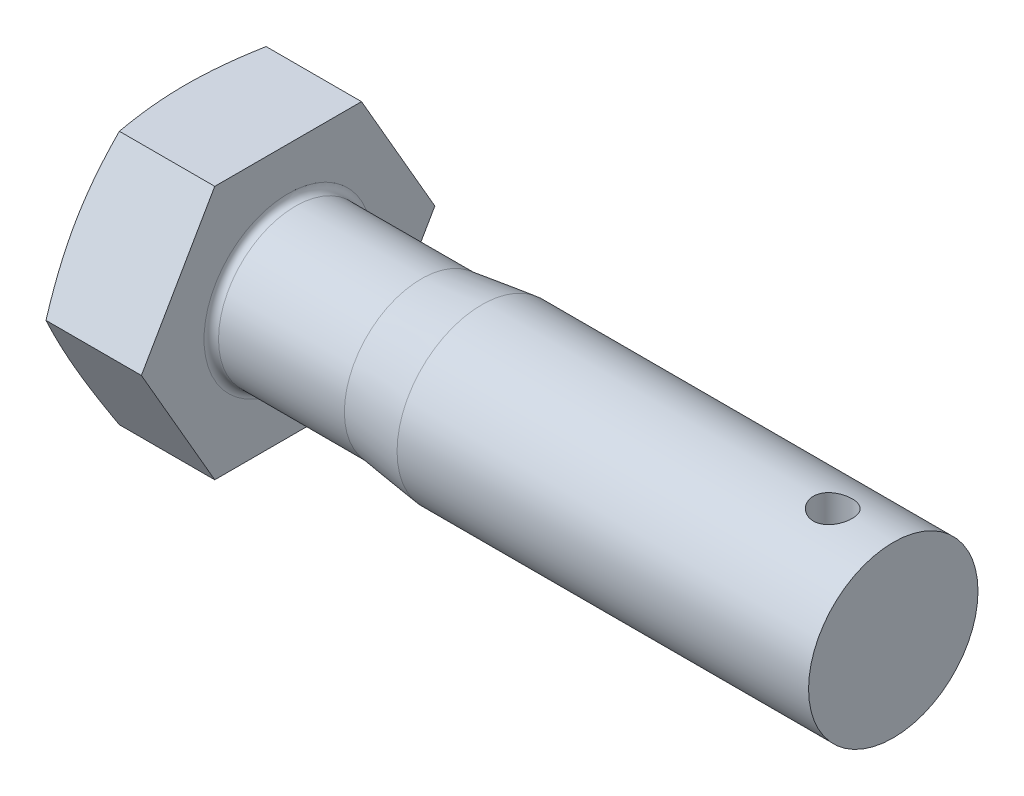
ISO-10303-21;
HEADER;
FILE_DESCRIPTION(('STEP AP214'),'2;1');
FILE_NAME('part.step','',(''),(''),'','','');
FILE_SCHEMA(('AUTOMOTIVE_DESIGN { 1 0 10303 214 1 1 1 1 }'));
ENDSEC;
DATA;
#1=APPLICATION_CONTEXT('core data for automotive mechanical design processes');
#2=APPLICATION_PROTOCOL_DEFINITION('international standard','automotive_design',2000,#1);
#3=PRODUCT_CONTEXT('',#1,'mechanical');
#4=PRODUCT('Part','Part','',(#3));
#5=PRODUCT_RELATED_PRODUCT_CATEGORY('part','',(#4));
#6=PRODUCT_DEFINITION_FORMATION('','',#4);
#7=PRODUCT_DEFINITION_CONTEXT('part definition',#1,'design');
#8=PRODUCT_DEFINITION('design','',#6,#7);
#9=PRODUCT_DEFINITION_SHAPE('','',#8);
#10=(LENGTH_UNIT() NAMED_UNIT(*) SI_UNIT(.MILLI.,.METRE.));
#11=(NAMED_UNIT(*) PLANE_ANGLE_UNIT() SI_UNIT($,.RADIAN.));
#12=(NAMED_UNIT(*) SI_UNIT($,.STERADIAN.) SOLID_ANGLE_UNIT());
#13=UNCERTAINTY_MEASURE_WITH_UNIT(LENGTH_MEASURE(1.E-05),#10,'distance_accuracy_value','');
#14=(GEOMETRIC_REPRESENTATION_CONTEXT(3) GLOBAL_UNCERTAINTY_ASSIGNED_CONTEXT((#13)) GLOBAL_UNIT_ASSIGNED_CONTEXT((#10,
#11,#12)) REPRESENTATION_CONTEXT('',''));
#15=CARTESIAN_POINT('',(0.,0.,0.));
#16=DIRECTION('',(0.,0.,1.));
#17=DIRECTION('',(1.,0.,0.));
#18=AXIS2_PLACEMENT_3D('',#15,#16,#17);
#19=CARTESIAN_POINT('',(0.,-10.5,-6.06217782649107));
#20=DIRECTION('',(1.,0.,0.));
#21=DIRECTION('',(0.,0.,-1.));
#22=AXIS2_PLACEMENT_3D('',#19,#20,#21);
#23=PLANE('',#22);
#24=CARTESIAN_POINT('',(0.,0.,0.));
#25=DIRECTION('',(-1.,0.,0.));
#26=DIRECTION('',(0.,0.,1.));
#27=AXIS2_PLACEMENT_3D('',#24,#25,#26);
#28=CIRCLE('',#27,9.6);
#29=CARTESIAN_POINT('',(0.,0.,9.6));
#30=VERTEX_POINT('',#29);
#31=EDGE_CURVE('E98',#30,#30,#28,.T.);
#32=ORIENTED_EDGE('',*,*,#31,.T.);
#33=EDGE_LOOP('',(#32));
#34=FACE_BOUND('',#33,.T.);
#35=CARTESIAN_POINT('',(0.,0.,0.));
#36=DIRECTION('',(1.,0.,0.));
#37=DIRECTION('',(0.,0.,-1.));
#38=AXIS2_PLACEMENT_3D('',#35,#36,#37);
#39=CIRCLE('',#38,7.85);
#40=CARTESIAN_POINT('',(0.,0.,-7.85));
#41=VERTEX_POINT('',#40);
#42=EDGE_CURVE('E231',#41,#41,#39,.T.);
#43=ORIENTED_EDGE('',*,*,#42,.T.);
#44=EDGE_LOOP('',(#43));
#45=FACE_BOUND('',#44,.T.);
#46=ADVANCED_FACE('F32',(#34,#45),#23,.F.);
#47=CARTESIAN_POINT('',(8.8,-10.5,6.06217782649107));
#48=DIRECTION('',(0.,1.,0.));
#49=DIRECTION('',(0.,0.,1.));
#50=AXIS2_PLACEMENT_3D('',#47,#48,#49);
#51=PLANE('',#50);
#52=CARTESIAN_POINT('',(3.4773071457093,-10.5,-16.019329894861));
#53=CARTESIAN_POINT('',(3.33283348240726,-10.5,-15.5445898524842));
#54=CARTESIAN_POINT('',(3.19005256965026,-10.5,-15.0693250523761));
#55=CARTESIAN_POINT('',(2.90881278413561,-10.5,-14.1174788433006));
#56=CARTESIAN_POINT('',(2.77035425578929,-10.5,-13.6408973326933));
#57=CARTESIAN_POINT('',(2.49846354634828,-10.5,-12.6853280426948));
#58=CARTESIAN_POINT('',(2.36504131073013,-10.5,-12.2063374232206));
#59=CARTESIAN_POINT('',(2.10479333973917,-10.5,-11.2465699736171));
#60=CARTESIAN_POINT('',(1.97796748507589,-10.5,-10.7657931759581));
#61=CARTESIAN_POINT('',(1.73407377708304,-10.5,-9.80813433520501));
#62=CARTESIAN_POINT('',(1.61690406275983,-10.5,-9.33127836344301));
#63=CARTESIAN_POINT('',(1.39258733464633,-10.5,-8.37519002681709));
#64=CARTESIAN_POINT('',(1.28544048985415,-10.5,-7.89595762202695));
#65=CARTESIAN_POINT('',(1.08367761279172,-10.5,-6.93501487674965));
#66=CARTESIAN_POINT('',(0.989057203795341,-10.5,-6.45330546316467));
#67=CARTESIAN_POINT('',(0.815236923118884,-10.5,-5.48709167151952));
#68=CARTESIAN_POINT('',(0.736036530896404,-10.5,-5.00258738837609));
#69=CARTESIAN_POINT('',(0.604125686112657,-10.5,-4.08539679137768));
#70=CARTESIAN_POINT('',(0.549439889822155,-10.5,-3.65299724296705));
#71=CARTESIAN_POINT('',(0.456973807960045,-10.5,-2.78637928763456));
#72=CARTESIAN_POINT('',(0.419193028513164,-10.5,-2.3521609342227));
#73=CARTESIAN_POINT('',(0.362356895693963,-10.5,-1.48278672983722));
#74=CARTESIAN_POINT('',(0.343288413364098,-10.5,-1.04763175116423));
#75=CARTESIAN_POINT('',(0.324841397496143,-10.5,-0.176900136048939));
#76=CARTESIAN_POINT('',(0.325462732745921,-10.5,0.258676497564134));
#77=CARTESIAN_POINT('',(0.346415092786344,-10.5,1.13158357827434));
#78=CARTESIAN_POINT('',(0.366847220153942,-10.5,1.56891155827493));
#79=CARTESIAN_POINT('',(0.426482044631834,-10.5,2.44227473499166));
#80=CARTESIAN_POINT('',(0.46568519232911,-10.5,2.87830990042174));
#81=CARTESIAN_POINT('',(0.561034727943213,-10.5,3.74887561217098));
#82=CARTESIAN_POINT('',(0.617195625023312,-10.5,4.18340454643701));
#83=CARTESIAN_POINT('',(0.744191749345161,-10.5,5.05028830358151));
#84=CARTESIAN_POINT('',(0.815027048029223,-10.5,5.48264311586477));
#85=CARTESIAN_POINT('',(0.973611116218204,-10.5,6.37050891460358));
#86=CARTESIAN_POINT('',(1.06211008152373,-10.5,6.82588472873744));
#87=CARTESIAN_POINT('',(1.25049804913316,-10.5,7.7342893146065));
#88=CARTESIAN_POINT('',(1.35038791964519,-10.5,8.18731790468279));
#89=CARTESIAN_POINT('',(1.5594505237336,-10.5,9.09135527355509));
#90=CARTESIAN_POINT('',(1.66862598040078,-10.5,9.54236341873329));
#91=CARTESIAN_POINT('',(1.89447776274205,-10.5,10.4424768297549));
#92=CARTESIAN_POINT('',(2.01115390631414,-10.5,10.8915821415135));
#93=CARTESIAN_POINT('',(2.25075411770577,-10.5,11.7887385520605));
#94=CARTESIAN_POINT('',(2.3736860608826,-10.5,12.2367875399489));
#95=CARTESIAN_POINT('',(2.624533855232,-10.5,13.1314862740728));
#96=CARTESIAN_POINT('',(2.75244972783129,-10.5,13.5781360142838));
#97=CARTESIAN_POINT('',(3.012348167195,-10.5,14.4701640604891));
#98=CARTESIAN_POINT('',(3.14433002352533,-10.5,14.9155425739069));
#99=CARTESIAN_POINT('',(3.41167894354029,-10.5,15.8052835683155));
#100=CARTESIAN_POINT('',(3.5470460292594,-10.5,16.2496460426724));
#101=CARTESIAN_POINT('',(3.95424477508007,-10.5,17.5713644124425));
#102=CARTESIAN_POINT('',(4.23015128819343,-10.5,18.4474646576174));
#103=CARTESIAN_POINT('',(4.78973757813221,-10.5,20.1972132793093));
#104=CARTESIAN_POINT('',(5.07341773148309,-10.5,21.0708615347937));
#105=CARTESIAN_POINT('',(5.64538538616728,-10.5,22.812966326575));
#106=CARTESIAN_POINT('',(5.93365126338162,-10.5,23.6814299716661));
#107=CARTESIAN_POINT('',(6.36922672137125,-10.5,24.9830205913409));
#108=CARTESIAN_POINT('',(6.51494203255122,-10.5,25.4166824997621));
#109=CARTESIAN_POINT('',(6.80730926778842,-10.5,26.2836893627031));
#110=CARTESIAN_POINT('',(6.95396118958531,-10.5,26.717034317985));
#111=CARTESIAN_POINT('',(7.10101876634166,-10.5,27.1502416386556));
#112=B_SPLINE_CURVE_WITH_KNOTS('',3,(#52,#53,#54,#55,#56,#57,#58,#59,#60,#61,#62,#63,#64,#65,
#66,#67,#68,#69,#70,#71,#72,#73,#74,#75,#76,#77,#78,#79,#80,#81,#82,#83,#84,#85,#86,#87,#88,#89,
#90,#91,#92,#93,#94,#95,#96,#97,#98,#99,#100,#101,#102,#103,#104,#105,#106,#107,#108,#109,#110,
#111),.UNSPECIFIED.,.F.,.F.,(4,2,2,2,2,2,2,2,2,2,2,2,2,2,2,2,2,2,2,2,2,2,2,2,2,2,2,2,2,4),(0.,
1.4887203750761,2.97755907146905,4.46919854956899,5.96081104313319,7.43384568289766,
8.90690515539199,10.3794485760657,11.8519422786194,13.1591861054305,14.4663917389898,
15.7726795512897,17.0789586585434,18.3919395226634,19.7049519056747,21.0190909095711,
22.3332363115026,23.7247442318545,25.1163582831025,26.5083818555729,27.9003716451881,
29.2941593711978,30.6879530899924,32.0815046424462,33.4750652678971,36.230561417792,
38.9861912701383,41.7313416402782,43.1038059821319,44.4762670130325),.UNSPECIFIED.);
#113=CARTESIAN_POINT('',(0.918790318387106,-10.5,-6.06217782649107));
#114=VERTEX_POINT('',#113);
#115=CARTESIAN_POINT('',(0.918790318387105,-10.5,6.06217782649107));
#116=VERTEX_POINT('',#115);
#117=EDGE_CURVE('E54',#114,#116,#112,.T.);
#118=ORIENTED_EDGE('',*,*,#117,.F.);
#119=DIRECTION('',(-1.,0.,0.));
#120=VECTOR('',#119,1.);
#121=CARTESIAN_POINT('',(8.8,-10.5,-6.06217782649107));
#122=LINE('',#121,#120);
#123=CARTESIAN_POINT('',(8.8,-10.5,-6.06217782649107));
#124=VERTEX_POINT('',#123);
#125=EDGE_CURVE('E123',#124,#114,#122,.T.);
#126=ORIENTED_EDGE('',*,*,#125,.F.);
#127=DIRECTION('',(0.,0.,-1.));
#128=VECTOR('',#127,1.);
#129=CARTESIAN_POINT('',(8.8,-10.5,6.06217782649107));
#130=LINE('',#129,#128);
#131=CARTESIAN_POINT('',(8.8,-10.5,6.06217782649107));
#132=VERTEX_POINT('',#131);
#133=EDGE_CURVE('E260',#132,#124,#130,.T.);
#134=ORIENTED_EDGE('',*,*,#133,.F.);
#135=DIRECTION('',(-1.,0.,0.));
#136=VECTOR('',#135,1.);
#137=CARTESIAN_POINT('',(8.8,-10.5,6.06217782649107));
#138=LINE('',#137,#136);
#139=EDGE_CURVE('E111',#132,#116,#138,.T.);
#140=ORIENTED_EDGE('',*,*,#139,.T.);
#141=EDGE_LOOP('',(#118,#126,#134,#140));
#142=FACE_BOUND('',#141,.T.);
#143=ADVANCED_FACE('F34',(#142),#51,.F.);
#144=CARTESIAN_POINT('',(8.8,-10.5,-6.06217782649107));
#145=DIRECTION('',(0.,0.5,0.866025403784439));
#146=DIRECTION('',(0.,-0.866025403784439,0.5));
#147=AXIS2_PLACEMENT_3D('',#144,#145,#146);
#148=PLANE('',#147);
#149=CARTESIAN_POINT('',(0.918832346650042,0.000200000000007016,-12.124471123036));
#150=CARTESIAN_POINT('',(0.827422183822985,-0.434644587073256,-11.8734134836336));
#151=CARTESIAN_POINT('',(0.744268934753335,-0.870923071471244,-11.6215279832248));
#152=CARTESIAN_POINT('',(0.597973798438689,-1.74631667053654,-11.1161192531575));
#153=CARTESIAN_POINT('',(0.53484756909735,-2.18543373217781,-10.8625948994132));
#154=CARTESIAN_POINT('',(0.432742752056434,-3.06163146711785,-10.3567219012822));
#155=CARTESIAN_POINT('',(0.393541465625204,-3.49869213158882,-10.1043848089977));
#156=CARTESIAN_POINT('',(0.340961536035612,-4.37383549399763,-9.59912055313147));
#157=CARTESIAN_POINT('',(0.327573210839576,-4.81191774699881,-9.34619364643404));
#158=CARTESIAN_POINT('',(0.327573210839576,-5.68808225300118,-8.84033983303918));
#159=CARTESIAN_POINT('',(0.340961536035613,-6.12616450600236,-8.58741292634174));
#160=CARTESIAN_POINT('',(0.393541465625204,-7.00130786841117,-8.08214867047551));
#161=CARTESIAN_POINT('',(0.432742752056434,-7.43836853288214,-7.829811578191));
#162=CARTESIAN_POINT('',(0.534847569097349,-8.31456626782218,-7.32393858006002));
#163=CARTESIAN_POINT('',(0.597973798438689,-8.75368332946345,-7.07041422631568));
#164=CARTESIAN_POINT('',(0.744268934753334,-9.62907692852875,-6.56500549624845));
#165=CARTESIAN_POINT('',(0.827422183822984,-10.0653554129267,-6.31311999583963));
#166=CARTESIAN_POINT('',(0.91883234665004,-10.5002,-6.06206235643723));
#167=B_SPLINE_CURVE_WITH_KNOTS('',3,(#149,#150,#151,#152,#153,#154,#155,#156,#157,#158,#159,
#160,#161,#162,#163,#164,#165,#166),.UNSPECIFIED.,.F.,.F.,(4,2,2,2,2,2,2,2,4),(0.,
1.5312621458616,3.06371855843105,4.58168385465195,6.09907967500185,7.61647549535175,
9.13444079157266,10.6668972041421,12.1981593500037),.UNSPECIFIED.);
#168=CARTESIAN_POINT('',(0.918790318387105,0.,-12.1243556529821));
#169=VERTEX_POINT('',#168);
#170=EDGE_CURVE('E193',#169,#114,#167,.T.);
#171=ORIENTED_EDGE('',*,*,#170,.F.);
#172=DIRECTION('',(-1.,0.,0.));
#173=VECTOR('',#172,1.);
#174=CARTESIAN_POINT('',(8.8,0.,-12.1243556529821));
#175=LINE('',#174,#173);
#176=CARTESIAN_POINT('',(8.8,0.,-12.1243556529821));
#177=VERTEX_POINT('',#176);
#178=EDGE_CURVE('E120',#177,#169,#175,.T.);
#179=ORIENTED_EDGE('',*,*,#178,.F.);
#180=DIRECTION('',(0.,0.866025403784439,-0.5));
#181=VECTOR('',#180,1.);
#182=CARTESIAN_POINT('',(8.8,-10.5,-6.06217782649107));
#183=LINE('',#182,#181);
#184=EDGE_CURVE('E261',#124,#177,#183,.T.);
#185=ORIENTED_EDGE('',*,*,#184,.F.);
#186=ORIENTED_EDGE('',*,*,#125,.T.);
#187=EDGE_LOOP('',(#171,#179,#185,#186));
#188=FACE_BOUND('',#187,.T.);
#189=ADVANCED_FACE('F201',(#188),#148,.F.);
#190=CARTESIAN_POINT('',(8.8,0.,-12.1243556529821));
#191=DIRECTION('',(0.,-0.5,0.866025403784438));
#192=DIRECTION('',(0.,-0.866025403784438,-0.5));
#193=AXIS2_PLACEMENT_3D('',#190,#191,#192);
#194=PLANE('',#193);
#195=CARTESIAN_POINT('',(0.918832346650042,10.5002,-6.06206235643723));
#196=CARTESIAN_POINT('',(0.827422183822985,10.0653554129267,-6.31311999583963));
#197=CARTESIAN_POINT('',(0.744268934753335,9.62907692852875,-6.56500549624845));
#198=CARTESIAN_POINT('',(0.59797379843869,8.75368332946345,-7.07041422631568));
#199=CARTESIAN_POINT('',(0.534847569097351,8.31456626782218,-7.32393858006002));
#200=CARTESIAN_POINT('',(0.432742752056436,7.43836853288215,-7.829811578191));
#201=CARTESIAN_POINT('',(0.393541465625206,7.00130786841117,-8.08214867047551));
#202=CARTESIAN_POINT('',(0.340961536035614,6.12616450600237,-8.58741292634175));
#203=CARTESIAN_POINT('',(0.327573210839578,5.68808225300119,-8.84033983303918));
#204=CARTESIAN_POINT('',(0.327573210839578,4.81191774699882,-9.34619364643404));
#205=CARTESIAN_POINT('',(0.340961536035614,4.37383549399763,-9.59912055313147));
#206=CARTESIAN_POINT('',(0.393541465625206,3.49869213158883,-10.1043848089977));
#207=CARTESIAN_POINT('',(0.432742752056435,3.06163146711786,-10.3567219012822));
#208=CARTESIAN_POINT('',(0.534847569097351,2.18543373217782,-10.8625948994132));
#209=CARTESIAN_POINT('',(0.59797379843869,1.74631667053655,-11.1161192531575));
#210=CARTESIAN_POINT('',(0.744268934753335,0.870923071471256,-11.6215279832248));
#211=CARTESIAN_POINT('',(0.827422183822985,0.434644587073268,-11.8734134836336));
#212=CARTESIAN_POINT('',(0.918832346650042,-0.000199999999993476,-12.124471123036));
#213=B_SPLINE_CURVE_WITH_KNOTS('',3,(#195,#196,#197,#198,#199,#200,#201,#202,#203,#204,#205,
#206,#207,#208,#209,#210,#211,#212),.UNSPECIFIED.,.F.,.F.,(4,2,2,2,2,2,2,2,4),(0.,
1.5312621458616,3.06371855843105,4.58168385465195,6.09907967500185,7.61647549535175,
9.13444079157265,10.6668972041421,12.1981593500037),.UNSPECIFIED.);
#214=CARTESIAN_POINT('',(0.918790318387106,10.5,-6.06217782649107));
#215=VERTEX_POINT('',#214);
#216=EDGE_CURVE('E187',#215,#169,#213,.T.);
#217=ORIENTED_EDGE('',*,*,#216,.F.);
#218=DIRECTION('',(-1.,0.,0.));
#219=VECTOR('',#218,1.);
#220=CARTESIAN_POINT('',(8.8,10.5,-6.06217782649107));
#221=LINE('',#220,#219);
#222=CARTESIAN_POINT('',(8.8,10.5,-6.06217782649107));
#223=VERTEX_POINT('',#222);
#224=EDGE_CURVE('E113',#223,#215,#221,.T.);
#225=ORIENTED_EDGE('',*,*,#224,.F.);
#226=DIRECTION('',(0.,0.866025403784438,0.5));
#227=VECTOR('',#226,1.);
#228=CARTESIAN_POINT('',(8.8,0.,-12.1243556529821));
#229=LINE('',#228,#227);
#230=EDGE_CURVE('E265',#177,#223,#229,.T.);
#231=ORIENTED_EDGE('',*,*,#230,.F.);
#232=ORIENTED_EDGE('',*,*,#178,.T.);
#233=EDGE_LOOP('',(#217,#225,#231,#232));
#234=FACE_BOUND('',#233,.T.);
#235=ADVANCED_FACE('F204',(#234),#194,.F.);
#236=CARTESIAN_POINT('',(8.8,10.5,-6.06217782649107));
#237=DIRECTION('',(0.,-1.,0.));
#238=DIRECTION('',(0.,0.,-1.));
#239=AXIS2_PLACEMENT_3D('',#236,#237,#238);
#240=PLANE('',#239);
#241=CARTESIAN_POINT('',(3.47730714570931,10.5,-16.019329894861));
#242=CARTESIAN_POINT('',(3.33283348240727,10.5,-15.5445898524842));
#243=CARTESIAN_POINT('',(3.19005256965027,10.5,-15.0693250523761));
#244=CARTESIAN_POINT('',(2.90881278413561,10.5,-14.1174788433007));
#245=CARTESIAN_POINT('',(2.77035425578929,10.5,-13.6408973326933));
#246=CARTESIAN_POINT('',(2.49846354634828,10.5,-12.6853280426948));
#247=CARTESIAN_POINT('',(2.36504131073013,10.5,-12.2063374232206));
#248=CARTESIAN_POINT('',(2.10479333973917,10.5,-11.2465699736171));
#249=CARTESIAN_POINT('',(1.97796748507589,10.5,-10.7657931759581));
#250=CARTESIAN_POINT('',(1.73407377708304,10.5,-9.80813433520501));
#251=CARTESIAN_POINT('',(1.61690406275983,10.5,-9.33127836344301));
#252=CARTESIAN_POINT('',(1.39258733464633,10.5,-8.37519002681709));
#253=CARTESIAN_POINT('',(1.28544048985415,10.5,-7.89595762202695));
#254=CARTESIAN_POINT('',(1.08367761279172,10.5,-6.93501487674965));
#255=CARTESIAN_POINT('',(0.989057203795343,10.5,-6.45330546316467));
#256=CARTESIAN_POINT('',(0.815236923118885,10.5,-5.48709167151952));
#257=CARTESIAN_POINT('',(0.736036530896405,10.5,-5.00258738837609));
#258=CARTESIAN_POINT('',(0.604125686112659,10.5,-4.08539679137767));
#259=CARTESIAN_POINT('',(0.549439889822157,10.5,-3.65299724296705));
#260=CARTESIAN_POINT('',(0.456973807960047,10.5,-2.78637928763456));
#261=CARTESIAN_POINT('',(0.419193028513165,10.5,-2.3521609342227));
#262=CARTESIAN_POINT('',(0.362356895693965,10.5,-1.48278672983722));
#263=CARTESIAN_POINT('',(0.3432884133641,10.5,-1.04763175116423));
#264=CARTESIAN_POINT('',(0.324841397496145,10.5,-0.176900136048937));
#265=CARTESIAN_POINT('',(0.325462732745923,10.5,0.258676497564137));
#266=CARTESIAN_POINT('',(0.346415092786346,10.5,1.13158357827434));
#267=CARTESIAN_POINT('',(0.366847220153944,10.5,1.56891155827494));
#268=CARTESIAN_POINT('',(0.426482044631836,10.5,2.44227473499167));
#269=CARTESIAN_POINT('',(0.465685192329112,10.5,2.87830990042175));
#270=CARTESIAN_POINT('',(0.561034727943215,10.5,3.74887561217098));
#271=CARTESIAN_POINT('',(0.617195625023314,10.5,4.18340454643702));
#272=CARTESIAN_POINT('',(0.744191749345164,10.5,5.05028830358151));
#273=CARTESIAN_POINT('',(0.815027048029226,10.5,5.48264311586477));
#274=CARTESIAN_POINT('',(0.973611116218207,10.5,6.37050891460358));
#275=CARTESIAN_POINT('',(1.06211008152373,10.5,6.82588472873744));
#276=CARTESIAN_POINT('',(1.25049804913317,10.5,7.73428931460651));
#277=CARTESIAN_POINT('',(1.35038791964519,10.5,8.1873179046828));
#278=CARTESIAN_POINT('',(1.55945052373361,10.5,9.09135527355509));
#279=CARTESIAN_POINT('',(1.66862598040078,10.5,9.54236341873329));
#280=CARTESIAN_POINT('',(1.89447776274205,10.5,10.4424768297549));
#281=CARTESIAN_POINT('',(2.01115390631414,10.5,10.8915821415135));
#282=CARTESIAN_POINT('',(2.25075411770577,10.5,11.7887385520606));
#283=CARTESIAN_POINT('',(2.37368606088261,10.5,12.2367875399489));
#284=CARTESIAN_POINT('',(2.624533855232,10.5,13.1314862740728));
#285=CARTESIAN_POINT('',(2.75244972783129,10.5,13.5781360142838));
#286=CARTESIAN_POINT('',(3.012348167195,10.5,14.4701640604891));
#287=CARTESIAN_POINT('',(3.14433002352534,10.5,14.9155425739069));
#288=CARTESIAN_POINT('',(3.41167894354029,10.5,15.8052835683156));
#289=CARTESIAN_POINT('',(3.5470460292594,10.5,16.2496460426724));
#290=CARTESIAN_POINT('',(3.95424477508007,10.5,17.5713644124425));
#291=CARTESIAN_POINT('',(4.23015128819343,10.5,18.4474646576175));
#292=CARTESIAN_POINT('',(4.78973757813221,10.5,20.1972132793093));
#293=CARTESIAN_POINT('',(5.07341773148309,10.5,21.0708615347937));
#294=CARTESIAN_POINT('',(5.64538538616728,10.5,22.812966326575));
#295=CARTESIAN_POINT('',(5.93365126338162,10.5,23.6814299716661));
#296=CARTESIAN_POINT('',(6.36922672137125,10.5,24.9830205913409));
#297=CARTESIAN_POINT('',(6.51494203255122,10.5,25.4166824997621));
#298=CARTESIAN_POINT('',(6.80730926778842,10.5,26.2836893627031));
#299=CARTESIAN_POINT('',(6.95396118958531,10.5,26.717034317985));
#300=CARTESIAN_POINT('',(7.10101876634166,10.5,27.1502416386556));
#301=B_SPLINE_CURVE_WITH_KNOTS('',3,(#241,#242,#243,#244,#245,#246,#247,#248,#249,#250,#251,
#252,#253,#254,#255,#256,#257,#258,#259,#260,#261,#262,#263,#264,#265,#266,#267,#268,#269,#270,
#271,#272,#273,#274,#275,#276,#277,#278,#279,#280,#281,#282,#283,#284,#285,#286,#287,#288,#289,
#290,#291,#292,#293,#294,#295,#296,#297,#298,#299,#300),.UNSPECIFIED.,.F.,.F.,(4,2,2,2,2,2,2,2,
2,2,2,2,2,2,2,2,2,2,2,2,2,2,2,2,2,2,2,2,2,4),(0.,1.4887203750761,2.97755907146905,
4.469198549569,5.96081104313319,7.43384568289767,8.906905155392,10.3794485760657,
11.8519422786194,13.1591861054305,14.4663917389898,15.7726795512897,17.0789586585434,
18.3919395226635,19.7049519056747,21.0190909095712,22.3332363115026,23.7247442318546,
25.1163582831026,26.5083818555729,27.9003716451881,29.2941593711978,30.6879530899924,
32.0815046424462,33.4750652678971,36.230561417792,38.9861912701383,41.7313416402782,
43.1038059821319,44.4762670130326),.UNSPECIFIED.);
#302=CARTESIAN_POINT('',(0.918790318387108,10.5,6.06217782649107));
#303=VERTEX_POINT('',#302);
#304=EDGE_CURVE('E108',#303,#215,#301,.F.);
#305=ORIENTED_EDGE('',*,*,#304,.F.);
#306=DIRECTION('',(-1.,0.,0.));
#307=VECTOR('',#306,1.);
#308=CARTESIAN_POINT('',(8.8,10.5,6.06217782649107));
#309=LINE('',#308,#307);
#310=CARTESIAN_POINT('',(8.8,10.5,6.06217782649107));
#311=VERTEX_POINT('',#310);
#312=EDGE_CURVE('E107',#311,#303,#309,.T.);
#313=ORIENTED_EDGE('',*,*,#312,.F.);
#314=DIRECTION('',(0.,0.,1.));
#315=VECTOR('',#314,1.);
#316=CARTESIAN_POINT('',(8.8,10.5,-6.06217782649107));
#317=LINE('',#316,#315);
#318=EDGE_CURVE('E267',#223,#311,#317,.T.);
#319=ORIENTED_EDGE('',*,*,#318,.F.);
#320=ORIENTED_EDGE('',*,*,#224,.T.);
#321=EDGE_LOOP('',(#305,#313,#319,#320));
#322=FACE_BOUND('',#321,.T.);
#323=ADVANCED_FACE('F208',(#322),#240,.F.);
#324=CARTESIAN_POINT('',(8.8,10.5,6.06217782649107));
#325=DIRECTION('',(0.,-0.5,-0.866025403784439));
#326=DIRECTION('',(0.,0.866025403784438,-0.5));
#327=AXIS2_PLACEMENT_3D('',#324,#325,#326);
#328=PLANE('',#327);
#329=CARTESIAN_POINT('',(0.918832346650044,-0.000199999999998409,12.124471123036));
#330=CARTESIAN_POINT('',(0.827422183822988,0.434644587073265,11.8734134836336));
#331=CARTESIAN_POINT('',(0.744268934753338,0.870923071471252,11.6215279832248));
#332=CARTESIAN_POINT('',(0.597973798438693,1.74631667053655,11.1161192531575));
#333=CARTESIAN_POINT('',(0.534847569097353,2.18543373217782,10.8625948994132));
#334=CARTESIAN_POINT('',(0.432742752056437,3.06163146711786,10.3567219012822));
#335=CARTESIAN_POINT('',(0.393541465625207,3.49869213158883,10.1043848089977));
#336=CARTESIAN_POINT('',(0.340961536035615,4.37383549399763,9.59912055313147));
#337=CARTESIAN_POINT('',(0.327573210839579,4.81191774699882,9.34619364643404));
#338=CARTESIAN_POINT('',(0.327573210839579,5.68808225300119,8.84033983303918));
#339=CARTESIAN_POINT('',(0.340961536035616,6.12616450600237,8.58741292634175));
#340=CARTESIAN_POINT('',(0.393541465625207,7.00130786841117,8.08214867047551));
#341=CARTESIAN_POINT('',(0.432742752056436,7.43836853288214,7.829811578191));
#342=CARTESIAN_POINT('',(0.534847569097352,8.31456626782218,7.32393858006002));
#343=CARTESIAN_POINT('',(0.597973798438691,8.75368332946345,7.07041422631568));
#344=CARTESIAN_POINT('',(0.744268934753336,9.62907692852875,6.56500549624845));
#345=CARTESIAN_POINT('',(0.827422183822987,10.0653554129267,6.31311999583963));
#346=CARTESIAN_POINT('',(0.918832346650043,10.5002,6.06206235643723));
#347=B_SPLINE_CURVE_WITH_KNOTS('',3,(#329,#330,#331,#332,#333,#334,#335,#336,#337,#338,#339,
#340,#341,#342,#343,#344,#345,#346),.UNSPECIFIED.,.F.,.F.,(4,2,2,2,2,2,2,2,4),(0.,
1.5312621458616,3.06371855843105,4.58168385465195,6.09907967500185,7.61647549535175,
9.13444079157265,10.6668972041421,12.1981593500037),.UNSPECIFIED.);
#348=CARTESIAN_POINT('',(0.918790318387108,0.,12.1243556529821));
#349=VERTEX_POINT('',#348);
#350=EDGE_CURVE('E93',#349,#303,#347,.T.);
#351=ORIENTED_EDGE('',*,*,#350,.F.);
#352=DIRECTION('',(-1.,0.,0.));
#353=VECTOR('',#352,1.);
#354=CARTESIAN_POINT('',(8.8,0.,12.1243556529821));
#355=LINE('',#354,#353);
#356=CARTESIAN_POINT('',(8.8,0.,12.1243556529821));
#357=VERTEX_POINT('',#356);
#358=EDGE_CURVE('E105',#357,#349,#355,.T.);
#359=ORIENTED_EDGE('',*,*,#358,.F.);
#360=DIRECTION('',(0.,-0.866025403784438,0.5));
#361=VECTOR('',#360,1.);
#362=CARTESIAN_POINT('',(8.8,10.5,6.06217782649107));
#363=LINE('',#362,#361);
#364=EDGE_CURVE('E269',#311,#357,#363,.T.);
#365=ORIENTED_EDGE('',*,*,#364,.F.);
#366=ORIENTED_EDGE('',*,*,#312,.T.);
#367=EDGE_LOOP('',(#351,#359,#365,#366));
#368=FACE_BOUND('',#367,.T.);
#369=ADVANCED_FACE('F103',(#368),#328,.F.);
#370=CARTESIAN_POINT('',(8.8,0.,12.1243556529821));
#371=DIRECTION('',(0.,0.5,-0.866025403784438));
#372=DIRECTION('',(0.,0.866025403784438,0.5));
#373=AXIS2_PLACEMENT_3D('',#370,#371,#372);
#374=PLANE('',#373);
#375=CARTESIAN_POINT('',(0.918832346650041,-10.5002,6.06206235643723));
#376=CARTESIAN_POINT('',(0.827422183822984,-10.0653554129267,6.31311999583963));
#377=CARTESIAN_POINT('',(0.744268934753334,-9.62907692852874,6.56500549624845));
#378=CARTESIAN_POINT('',(0.59797379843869,-8.75368332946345,7.07041422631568));
#379=CARTESIAN_POINT('',(0.534847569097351,-8.31456626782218,7.32393858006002));
#380=CARTESIAN_POINT('',(0.432742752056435,-7.43836853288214,7.82981157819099));
#381=CARTESIAN_POINT('',(0.393541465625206,-7.00130786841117,8.08214867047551));
#382=CARTESIAN_POINT('',(0.340961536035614,-6.12616450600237,8.58741292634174));
#383=CARTESIAN_POINT('',(0.327573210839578,-5.68808225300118,8.84033983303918));
#384=CARTESIAN_POINT('',(0.327573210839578,-4.81191774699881,9.34619364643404));
#385=CARTESIAN_POINT('',(0.340961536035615,-4.37383549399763,9.59912055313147));
#386=CARTESIAN_POINT('',(0.393541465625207,-3.49869213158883,10.1043848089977));
#387=CARTESIAN_POINT('',(0.432742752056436,-3.06163146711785,10.3567219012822));
#388=CARTESIAN_POINT('',(0.534847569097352,-2.18543373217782,10.8625948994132));
#389=CARTESIAN_POINT('',(0.597973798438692,-1.74631667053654,11.1161192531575));
#390=CARTESIAN_POINT('',(0.744268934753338,-0.870923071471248,11.6215279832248));
#391=CARTESIAN_POINT('',(0.827422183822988,-0.43464458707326,11.8734134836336));
#392=CARTESIAN_POINT('',(0.918832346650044,0.000200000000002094,12.124471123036));
#393=B_SPLINE_CURVE_WITH_KNOTS('',3,(#375,#376,#377,#378,#379,#380,#381,#382,#383,#384,#385,
#386,#387,#388,#389,#390,#391,#392),.UNSPECIFIED.,.F.,.F.,(4,2,2,2,2,2,2,2,4),(0.,
1.5312621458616,3.06371855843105,4.58168385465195,6.09907967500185,7.61647549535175,
9.13444079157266,10.6668972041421,12.1981593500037),.UNSPECIFIED.);
#394=EDGE_CURVE('E90',#116,#349,#393,.T.);
#395=ORIENTED_EDGE('',*,*,#394,.F.);
#396=ORIENTED_EDGE('',*,*,#139,.F.);
#397=DIRECTION('',(0.,-0.866025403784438,-0.5));
#398=VECTOR('',#397,1.);
#399=CARTESIAN_POINT('',(8.8,0.,12.1243556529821));
#400=LINE('',#399,#398);
#401=EDGE_CURVE('E62',#357,#132,#400,.T.);
#402=ORIENTED_EDGE('',*,*,#401,.F.);
#403=ORIENTED_EDGE('',*,*,#358,.T.);
#404=EDGE_LOOP('',(#395,#396,#402,#403));
#405=FACE_BOUND('',#404,.T.);
#406=ADVANCED_FACE('F110',(#405),#374,.F.);
#407=CARTESIAN_POINT('',(8.8,-10.5,-6.06217782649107));
#408=DIRECTION('',(1.,0.,0.));
#409=DIRECTION('',(0.,0.,-1.));
#410=AXIS2_PLACEMENT_3D('',#407,#408,#409);
#411=PLANE('',#410);
#412=CARTESIAN_POINT('',(8.8,0.,0.));
#413=DIRECTION('',(1.,0.,0.));
#414=DIRECTION('',(0.,0.,-1.));
#415=AXIS2_PLACEMENT_3D('',#412,#413,#414);
#416=CIRCLE('',#415,6.9505);
#417=CARTESIAN_POINT('',(8.8,0.,-6.9505));
#418=VERTEX_POINT('',#417);
#419=EDGE_CURVE('E46',#418,#418,#416,.F.);
#420=ORIENTED_EDGE('',*,*,#419,.T.);
#421=EDGE_LOOP('',(#420));
#422=FACE_BOUND('',#421,.T.);
#423=ORIENTED_EDGE('',*,*,#133,.T.);
#424=ORIENTED_EDGE('',*,*,#184,.T.);
#425=ORIENTED_EDGE('',*,*,#230,.T.);
#426=ORIENTED_EDGE('',*,*,#318,.T.);
#427=ORIENTED_EDGE('',*,*,#364,.T.);
#428=ORIENTED_EDGE('',*,*,#401,.T.);
#429=EDGE_LOOP('',(#423,#424,#425,#426,#427,#428));
#430=FACE_BOUND('',#429,.T.);
#431=ADVANCED_FACE('F164',(#422,#430),#411,.T.);
#432=CARTESIAN_POINT('',(0.,0.,0.));
#433=DIRECTION('',(1.,0.,0.));
#434=DIRECTION('',(0.,0.,-1.));
#435=AXIS2_PLACEMENT_3D('',#432,#433,#434);
#436=CONICAL_SURFACE('',#435,9.6,1.22173047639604);
#437=ORIENTED_EDGE('',*,*,#31,.F.);
#438=EDGE_LOOP('',(#437));
#439=FACE_BOUND('',#438,.T.);
#440=ORIENTED_EDGE('',*,*,#117,.T.);
#441=ORIENTED_EDGE('',*,*,#394,.T.);
#442=ORIENTED_EDGE('',*,*,#350,.T.);
#443=ORIENTED_EDGE('',*,*,#304,.T.);
#444=ORIENTED_EDGE('',*,*,#216,.T.);
#445=ORIENTED_EDGE('',*,*,#170,.T.);
#446=EDGE_LOOP('',(#440,#441,#442,#443,#444,#445));
#447=FACE_BOUND('',#446,.T.);
#448=ADVANCED_FACE('F92',(#439,#447),#436,.T.);
#449=CARTESIAN_POINT('',(1.76,0.,0.));
#450=DIRECTION('',(-1.,0.,0.));
#451=DIRECTION('',(0.,0.,1.));
#452=AXIS2_PLACEMENT_3D('',#449,#450,#451);
#453=CYLINDRICAL_SURFACE('',#452,7.85);
#454=CARTESIAN_POINT('',(1.76,0.,0.));
#455=DIRECTION('',(1.,0.,0.));
#456=DIRECTION('',(0.,0.,-1.));
#457=AXIS2_PLACEMENT_3D('',#454,#455,#456);
#458=CIRCLE('',#457,7.85);
#459=CARTESIAN_POINT('',(1.76,0.,-7.85));
#460=VERTEX_POINT('',#459);
#461=EDGE_CURVE('E233',#460,#460,#458,.T.);
#462=ORIENTED_EDGE('',*,*,#461,.T.);
#463=EDGE_LOOP('',(#462));
#464=FACE_BOUND('',#463,.T.);
#465=ORIENTED_EDGE('',*,*,#42,.F.);
#466=EDGE_LOOP('',(#465));
#467=FACE_BOUND('',#466,.T.);
#468=ADVANCED_FACE('F157',(#464,#467),#453,.F.);
#469=CARTESIAN_POINT('',(1.76,0.,0.));
#470=DIRECTION('',(1.,0.,0.));
#471=DIRECTION('',(0.,0.,-1.));
#472=AXIS2_PLACEMENT_3D('',#469,#470,#471);
#473=PLANE('',#472);
#474=ORIENTED_EDGE('',*,*,#461,.F.);
#475=EDGE_LOOP('',(#474));
#476=FACE_BOUND('',#475,.T.);
#477=ADVANCED_FACE('F153',(#476),#473,.F.);
#478=CARTESIAN_POINT('',(19.8,0.,0.));
#479=DIRECTION('',(1.,0.,0.));
#480=DIRECTION('',(0.,0.,-1.));
#481=AXIS2_PLACEMENT_3D('',#478,#479,#480);
#482=CONICAL_SURFACE('',#481,6.3505,0.129176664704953);
#483=CARTESIAN_POINT('',(24.8,0.,0.));
#484=DIRECTION('',(-1.,0.,0.));
#485=DIRECTION('',(0.,0.,1.));
#486=AXIS2_PLACEMENT_3D('',#483,#484,#485);
#487=CIRCLE('',#486,7.);
#488=CARTESIAN_POINT('',(24.8,0.,7.));
#489=VERTEX_POINT('',#488);
#490=EDGE_CURVE('E234',#489,#489,#487,.T.);
#491=ORIENTED_EDGE('',*,*,#490,.T.);
#492=EDGE_LOOP('',(#491));
#493=FACE_BOUND('',#492,.T.);
#494=CARTESIAN_POINT('',(19.8,0.,0.));
#495=DIRECTION('',(-1.,0.,0.));
#496=DIRECTION('',(0.,0.,1.));
#497=AXIS2_PLACEMENT_3D('',#494,#495,#496);
#498=CIRCLE('',#497,6.3505);
#499=CARTESIAN_POINT('',(19.8,0.,6.3505));
#500=VERTEX_POINT('',#499);
#501=EDGE_CURVE('E239',#500,#500,#498,.T.);
#502=ORIENTED_EDGE('',*,*,#501,.F.);
#503=EDGE_LOOP('',(#502));
#504=FACE_BOUND('',#503,.T.);
#505=ADVANCED_FACE('F149',(#493,#504),#482,.T.);
#506=CARTESIAN_POINT('',(0.,0.,0.));
#507=DIRECTION('',(-1.,0.,0.));
#508=DIRECTION('',(0.,0.,1.));
#509=AXIS2_PLACEMENT_3D('',#506,#507,#508);
#510=CYLINDRICAL_SURFACE('',#509,6.3505);
#511=CARTESIAN_POINT('',(9.4,0.,0.));
#512=DIRECTION('',(1.,0.,0.));
#513=DIRECTION('',(0.,0.,-1.));
#514=AXIS2_PLACEMENT_3D('',#511,#512,#513);
#515=CIRCLE('',#514,6.3505);
#516=CARTESIAN_POINT('',(9.4,0.,-6.3505));
#517=VERTEX_POINT('',#516);
#518=EDGE_CURVE('E11',#517,#517,#515,.T.);
#519=ORIENTED_EDGE('',*,*,#518,.T.);
#520=EDGE_LOOP('',(#519));
#521=FACE_BOUND('',#520,.T.);
#522=ORIENTED_EDGE('',*,*,#501,.T.);
#523=EDGE_LOOP('',(#522));
#524=FACE_BOUND('',#523,.T.);
#525=ADVANCED_FACE('F145',(#521,#524),#510,.T.);
#526=CARTESIAN_POINT('',(58.8,0.,0.));
#527=DIRECTION('',(1.,0.,0.));
#528=DIRECTION('',(0.,0.,-1.));
#529=AXIS2_PLACEMENT_3D('',#526,#527,#528);
#530=PLANE('',#529);
#531=CARTESIAN_POINT('',(58.8,0.,0.));
#532=DIRECTION('',(1.,0.,0.));
#533=DIRECTION('',(0.,0.,-1.));
#534=AXIS2_PLACEMENT_3D('',#531,#532,#533);
#535=CIRCLE('',#534,7.);
#536=CARTESIAN_POINT('',(58.8,0.,-7.));
#537=VERTEX_POINT('',#536);
#538=EDGE_CURVE('E256',#537,#537,#535,.T.);
#539=ORIENTED_EDGE('',*,*,#538,.T.);
#540=EDGE_LOOP('',(#539));
#541=FACE_BOUND('',#540,.T.);
#542=ADVANCED_FACE('F148',(#541),#530,.T.);
#543=CARTESIAN_POINT('',(58.8,0.,0.));
#544=DIRECTION('',(-1.,0.,0.));
#545=DIRECTION('',(0.,0.,1.));
#546=AXIS2_PLACEMENT_3D('',#543,#544,#545);
#547=CYLINDRICAL_SURFACE('',#546,7.);
#548=CARTESIAN_POINT('',(53.8,-6.81469001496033,1.6));
#549=CARTESIAN_POINT('',(53.8886038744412,-6.81469179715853,1.59999709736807));
#550=CARTESIAN_POINT('',(53.9772417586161,-6.81643687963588,1.59261497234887));
#551=CARTESIAN_POINT('',(54.1519894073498,-6.8232143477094,1.56331823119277));
#552=CARTESIAN_POINT('',(54.2380974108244,-6.82824896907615,1.54139373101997));
#553=CARTESIAN_POINT('',(54.405232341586,-6.84100620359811,1.48374478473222));
#554=CARTESIAN_POINT('',(54.4862650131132,-6.84872571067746,1.44803627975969));
#555=CARTESIAN_POINT('',(54.6411934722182,-6.86597915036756,1.3638795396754));
#556=CARTESIAN_POINT('',(54.7150892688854,-6.87551308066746,1.31543132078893));
#557=CARTESIAN_POINT('',(54.8550087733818,-6.89551755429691,1.2062181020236));
#558=CARTESIAN_POINT('',(54.9208817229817,-6.90600100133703,1.14526228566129));
#559=CARTESIAN_POINT('',(55.0415629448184,-6.92661063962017,1.01317585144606));
#560=CARTESIAN_POINT('',(55.0963703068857,-6.93673680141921,0.942044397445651));
#561=CARTESIAN_POINT('',(55.1939671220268,-6.95563214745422,0.790608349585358));
#562=CARTESIAN_POINT('',(55.2366106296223,-6.9643843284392,0.710207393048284));
#563=CARTESIAN_POINT('',(55.3077236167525,-6.97939938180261,0.543146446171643));
#564=CARTESIAN_POINT('',(55.3361948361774,-6.98566255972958,0.456487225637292));
#565=CARTESIAN_POINT('',(55.3776782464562,-6.99490272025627,0.280938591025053));
#566=CARTESIAN_POINT('',(55.3909458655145,-6.99793393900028,0.192112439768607));
#567=CARTESIAN_POINT('',(55.402445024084,-7.00055688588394,0.0134468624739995));
#568=CARTESIAN_POINT('',(55.4006784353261,-7.00014904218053,-0.0763924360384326));
#569=CARTESIAN_POINT('',(55.3823476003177,-6.99598094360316,-0.252770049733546));
#570=CARTESIAN_POINT('',(55.3660587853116,-6.99228309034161,-0.339338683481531));
#571=CARTESIAN_POINT('',(55.3195859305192,-6.9820220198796,-0.508480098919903));
#572=CARTESIAN_POINT('',(55.2894012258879,-6.97545866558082,-0.591052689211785));
#573=CARTESIAN_POINT('',(55.215756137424,-6.9601051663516,-0.750610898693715));
#574=CARTESIAN_POINT('',(55.172193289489,-6.95129792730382,-0.827547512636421));
#575=CARTESIAN_POINT('',(55.0731052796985,-6.93241931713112,-0.973117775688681));
#576=CARTESIAN_POINT('',(55.0175783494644,-6.9223477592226,-1.04175019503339));
#577=CARTESIAN_POINT('',(54.8946455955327,-6.90177529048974,-1.17040358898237));
#578=CARTESIAN_POINT('',(54.826998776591,-6.89126982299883,-1.23019377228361));
#579=CARTESIAN_POINT('',(54.6825291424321,-6.87122620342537,-1.33762692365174));
#580=CARTESIAN_POINT('',(54.6057060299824,-6.86168808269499,-1.38526949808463));
#581=CARTESIAN_POINT('',(54.4446676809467,-6.8446456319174,-1.46717089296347));
#582=CARTESIAN_POINT('',(54.3604276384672,-6.83714849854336,-1.50138253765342));
#583=CARTESIAN_POINT('',(54.1871812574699,-6.82513398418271,-1.55509212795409));
#584=CARTESIAN_POINT('',(54.0981757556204,-6.82061608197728,-1.57459264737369));
#585=CARTESIAN_POINT('',(53.9200433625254,-6.81517884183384,-1.5979610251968));
#586=CARTESIAN_POINT('',(53.8309630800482,-6.81418180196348,-1.60216649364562));
#587=CARTESIAN_POINT('',(53.6533741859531,-6.81568899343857,-1.59574253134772));
#588=CARTESIAN_POINT('',(53.5648655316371,-6.81819296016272,-1.58511422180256));
#589=CARTESIAN_POINT('',(53.3921311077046,-6.82634632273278,-1.54961829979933));
#590=CARTESIAN_POINT('',(53.3078643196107,-6.83195391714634,-1.52493979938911));
#591=CARTESIAN_POINT('',(53.1446621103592,-6.84564439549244,-1.46225025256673));
#592=CARTESIAN_POINT('',(53.0657272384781,-6.85372753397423,-1.42423783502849));
#593=CARTESIAN_POINT('',(52.9139776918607,-6.87162689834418,-1.33522697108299));
#594=CARTESIAN_POINT('',(52.8412871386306,-6.88146979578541,-1.28402239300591));
#595=CARTESIAN_POINT('',(52.7054063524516,-6.90171081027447,-1.17034766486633));
#596=CARTESIAN_POINT('',(52.6422174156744,-6.91210900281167,-1.10787598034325));
#597=CARTESIAN_POINT('',(52.5258059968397,-6.93254731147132,-0.971906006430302));
#598=CARTESIAN_POINT('',(52.4728147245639,-6.94257569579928,-0.898207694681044));
#599=CARTESIAN_POINT('',(52.3799639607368,-6.96092116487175,-0.742760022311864));
#600=CARTESIAN_POINT('',(52.3401038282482,-6.96923833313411,-0.661011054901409));
#601=CARTESIAN_POINT('',(52.2749602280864,-6.98317517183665,-0.492313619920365));
#602=CARTESIAN_POINT('',(52.2495799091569,-6.98881272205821,-0.405404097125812));
#603=CARTESIAN_POINT('',(52.2138169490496,-6.99683275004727,-0.228410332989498));
#604=CARTESIAN_POINT('',(52.2034319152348,-6.99921574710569,-0.13832660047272));
#605=CARTESIAN_POINT('',(52.1980701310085,-7.00044100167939,0.0402706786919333));
#606=CARTESIAN_POINT('',(52.2027494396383,-6.99936229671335,0.12877352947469));
#607=CARTESIAN_POINT('',(52.2266086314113,-6.99395647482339,0.303695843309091));
#608=CARTESIAN_POINT('',(52.245788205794,-6.98962942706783,0.390115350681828));
#609=CARTESIAN_POINT('',(52.2979324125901,-6.9782209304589,0.558123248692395));
#610=CARTESIAN_POINT('',(52.3308441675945,-6.97115005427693,0.639728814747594));
#611=CARTESIAN_POINT('',(52.4094684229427,-6.95500562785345,0.796303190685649));
#612=CARTESIAN_POINT('',(52.4551822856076,-6.94593186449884,0.871271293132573));
#613=CARTESIAN_POINT('',(52.559212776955,-6.92653554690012,1.01410673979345));
#614=CARTESIAN_POINT('',(52.6177687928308,-6.91619118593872,1.08179678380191));
#615=CARTESIAN_POINT('',(52.7453438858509,-6.89553082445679,1.20650719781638));
#616=CARTESIAN_POINT('',(52.8143655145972,-6.88521483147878,1.26352495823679));
#617=CARTESIAN_POINT('',(52.962150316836,-6.86560672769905,1.36609616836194));
#618=CARTESIAN_POINT('',(53.04104333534,-6.85633216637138,1.41146610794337));
#619=CARTESIAN_POINT('',(53.2055324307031,-6.84008185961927,1.48823092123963));
#620=CARTESIAN_POINT('',(53.2911230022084,-6.83310425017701,1.5196371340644));
#621=CARTESIAN_POINT('',(53.4472788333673,-6.82346893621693,1.56225215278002));
#622=CARTESIAN_POINT('',(53.5170245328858,-6.8201995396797,1.57637937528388));
#623=CARTESIAN_POINT('',(53.6578395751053,-6.81580942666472,1.59525419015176));
#624=CARTESIAN_POINT('',(53.7289088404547,-6.8146885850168,1.60000232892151));
#625=CARTESIAN_POINT('',(53.8,-6.81469001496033,1.6));
#626=B_SPLINE_CURVE_WITH_KNOTS('',3,(#548,#549,#550,#551,#552,#553,#554,#555,#556,#557,#558,
#559,#560,#561,#562,#563,#564,#565,#566,#567,#568,#569,#570,#571,#572,#573,#574,#575,#576,#577,
#578,#579,#580,#581,#582,#583,#584,#585,#586,#587,#588,#589,#590,#591,#592,#593,#594,#595,#596,
#597,#598,#599,#600,#601,#602,#603,#604,#605,#606,#607,#608,#609,#610,#611,#612,#613,#614,#615,
#616,#617,#618,#619,#620,#621,#622,#623,#624,#625),.UNSPECIFIED.,.T.,.F.,(4,2,2,2,2,2,2,2,2,2,2,
2,2,2,2,2,2,2,2,2,2,2,2,2,2,2,2,2,2,2,2,2,2,2,2,2,2,2,4),(0.,0.265550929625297,
0.531282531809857,0.796707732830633,1.06213259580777,1.3319562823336,1.6018021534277,
1.87476123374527,2.14768679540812,2.41595655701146,2.68419292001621,2.94744760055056,
3.21071487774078,3.47605106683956,3.74142650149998,4.01282473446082,4.28423176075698,
4.55658374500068,4.82888806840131,5.0951439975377,5.36137980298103,5.62411410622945,
5.88687543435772,6.15402187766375,6.42120473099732,6.69387211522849,6.96652618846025,
7.23733450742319,7.50809961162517,7.77272697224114,8.03734869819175,8.30096073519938,
8.56460083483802,8.83365149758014,9.10276786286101,9.37589474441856,9.64879942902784,
9.86187615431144,10.0749404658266),.UNSPECIFIED.);
#627=CARTESIAN_POINT('',(53.8,-6.81469001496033,1.6));
#628=VERTEX_POINT('',#627);
#629=EDGE_CURVE('E37',#628,#628,#626,.T.);
#630=ORIENTED_EDGE('',*,*,#629,.T.);
#631=EDGE_LOOP('',(#630));
#632=FACE_BOUND('',#631,.T.);
#633=CARTESIAN_POINT('',(53.8,6.81469001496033,1.6));
#634=CARTESIAN_POINT('',(53.7113961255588,6.81469179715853,1.59999709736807));
#635=CARTESIAN_POINT('',(53.6227582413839,6.81643687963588,1.59261497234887));
#636=CARTESIAN_POINT('',(53.4480105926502,6.8232143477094,1.56331823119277));
#637=CARTESIAN_POINT('',(53.3619025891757,6.82824896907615,1.54139373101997));
#638=CARTESIAN_POINT('',(53.194767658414,6.84100620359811,1.48374478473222));
#639=CARTESIAN_POINT('',(53.1137349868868,6.84872571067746,1.44803627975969));
#640=CARTESIAN_POINT('',(52.9588065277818,6.86597915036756,1.3638795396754));
#641=CARTESIAN_POINT('',(52.8849107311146,6.87551308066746,1.31543132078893));
#642=CARTESIAN_POINT('',(52.7449912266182,6.89551755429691,1.2062181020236));
#643=CARTESIAN_POINT('',(52.6791182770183,6.90600100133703,1.14526228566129));
#644=CARTESIAN_POINT('',(52.5584370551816,6.92661063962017,1.01317585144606));
#645=CARTESIAN_POINT('',(52.5036296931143,6.93673680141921,0.942044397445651));
#646=CARTESIAN_POINT('',(52.4060328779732,6.95563214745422,0.790608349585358));
#647=CARTESIAN_POINT('',(52.3633893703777,6.9643843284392,0.710207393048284));
#648=CARTESIAN_POINT('',(52.2922763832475,6.97939938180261,0.543146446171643));
#649=CARTESIAN_POINT('',(52.2638051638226,6.98566255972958,0.456487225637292));
#650=CARTESIAN_POINT('',(52.2223217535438,6.99490272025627,0.280938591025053));
#651=CARTESIAN_POINT('',(52.2090541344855,6.99793393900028,0.192112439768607));
#652=CARTESIAN_POINT('',(52.197554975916,7.00055688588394,0.0134468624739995));
#653=CARTESIAN_POINT('',(52.1993215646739,7.00014904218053,-0.0763924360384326));
#654=CARTESIAN_POINT('',(52.2176523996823,6.99598094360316,-0.252770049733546));
#655=CARTESIAN_POINT('',(52.2339412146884,6.99228309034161,-0.339338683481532));
#656=CARTESIAN_POINT('',(52.2804140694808,6.9820220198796,-0.508480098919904));
#657=CARTESIAN_POINT('',(52.3105987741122,6.97545866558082,-0.591052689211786));
#658=CARTESIAN_POINT('',(52.384243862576,6.9601051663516,-0.750610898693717));
#659=CARTESIAN_POINT('',(52.427806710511,6.95129792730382,-0.827547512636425));
#660=CARTESIAN_POINT('',(52.5268947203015,6.93241931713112,-0.973117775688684));
#661=CARTESIAN_POINT('',(52.5824216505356,6.9223477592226,-1.04175019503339));
#662=CARTESIAN_POINT('',(52.7053544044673,6.90177529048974,-1.17040358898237));
#663=CARTESIAN_POINT('',(52.773001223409,6.89126982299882,-1.23019377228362));
#664=CARTESIAN_POINT('',(52.9174708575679,6.87122620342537,-1.33762692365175));
#665=CARTESIAN_POINT('',(52.9942939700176,6.86168808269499,-1.38526949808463));
#666=CARTESIAN_POINT('',(53.1553323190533,6.8446456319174,-1.46717089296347));
#667=CARTESIAN_POINT('',(53.2395723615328,6.83714849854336,-1.50138253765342));
#668=CARTESIAN_POINT('',(53.4128187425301,6.82513398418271,-1.55509212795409));
#669=CARTESIAN_POINT('',(53.5018242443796,6.82061608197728,-1.57459264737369));
#670=CARTESIAN_POINT('',(53.6799566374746,6.81517884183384,-1.5979610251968));
#671=CARTESIAN_POINT('',(53.7690369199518,6.81418180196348,-1.60216649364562));
#672=CARTESIAN_POINT('',(53.9466258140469,6.81568899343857,-1.59574253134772));
#673=CARTESIAN_POINT('',(54.0351344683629,6.81819296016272,-1.58511422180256));
#674=CARTESIAN_POINT('',(54.2078688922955,6.82634632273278,-1.54961829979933));
#675=CARTESIAN_POINT('',(54.2921356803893,6.83195391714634,-1.52493979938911));
#676=CARTESIAN_POINT('',(54.4553378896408,6.84564439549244,-1.46225025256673));
#677=CARTESIAN_POINT('',(54.5342727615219,6.85372753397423,-1.42423783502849));
#678=CARTESIAN_POINT('',(54.6860223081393,6.87162689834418,-1.33522697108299));
#679=CARTESIAN_POINT('',(54.7587128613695,6.88146979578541,-1.2840223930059));
#680=CARTESIAN_POINT('',(54.8945936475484,6.90171081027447,-1.17034766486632));
#681=CARTESIAN_POINT('',(54.9577825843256,6.91210900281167,-1.10787598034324));
#682=CARTESIAN_POINT('',(55.0741940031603,6.93254731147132,-0.971906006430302));
#683=CARTESIAN_POINT('',(55.1271852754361,6.94257569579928,-0.898207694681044));
#684=CARTESIAN_POINT('',(55.2200360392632,6.96092116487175,-0.742760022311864));
#685=CARTESIAN_POINT('',(55.2598961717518,6.96923833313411,-0.661011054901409));
#686=CARTESIAN_POINT('',(55.3250397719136,6.98317517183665,-0.492313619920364));
#687=CARTESIAN_POINT('',(55.3504200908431,6.98881272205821,-0.40540409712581));
#688=CARTESIAN_POINT('',(55.3861830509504,6.99683275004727,-0.228410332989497));
#689=CARTESIAN_POINT('',(55.3965680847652,6.99921574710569,-0.138326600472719));
#690=CARTESIAN_POINT('',(55.4019298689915,7.00044100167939,0.0402706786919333));
#691=CARTESIAN_POINT('',(55.3972505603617,6.99936229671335,0.12877352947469));
#692=CARTESIAN_POINT('',(55.3733913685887,6.99395647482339,0.303695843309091));
#693=CARTESIAN_POINT('',(55.354211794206,6.98962942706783,0.390115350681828));
#694=CARTESIAN_POINT('',(55.3020675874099,6.9782209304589,0.558123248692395));
#695=CARTESIAN_POINT('',(55.2691558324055,6.97115005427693,0.639728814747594));
#696=CARTESIAN_POINT('',(55.1905315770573,6.95500562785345,0.796303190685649));
#697=CARTESIAN_POINT('',(55.1448177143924,6.94593186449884,0.871271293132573));
#698=CARTESIAN_POINT('',(55.040787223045,6.92653554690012,1.01410673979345));
#699=CARTESIAN_POINT('',(54.9822312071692,6.91619118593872,1.08179678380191));
#700=CARTESIAN_POINT('',(54.8546561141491,6.89553082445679,1.20650719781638));
#701=CARTESIAN_POINT('',(54.7856344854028,6.88521483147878,1.26352495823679));
#702=CARTESIAN_POINT('',(54.637849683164,6.86560672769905,1.36609616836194));
#703=CARTESIAN_POINT('',(54.55895666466,6.85633216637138,1.41146610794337));
#704=CARTESIAN_POINT('',(54.3944675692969,6.84008185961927,1.48823092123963));
#705=CARTESIAN_POINT('',(54.3088769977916,6.83310425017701,1.5196371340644));
#706=CARTESIAN_POINT('',(54.1527211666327,6.82346893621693,1.56225215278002));
#707=CARTESIAN_POINT('',(54.0829754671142,6.8201995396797,1.57637937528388));
#708=CARTESIAN_POINT('',(53.9421604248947,6.81580942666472,1.59525419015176));
#709=CARTESIAN_POINT('',(53.8710911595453,6.8146885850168,1.60000232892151));
#710=CARTESIAN_POINT('',(53.8,6.81469001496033,1.6));
#711=B_SPLINE_CURVE_WITH_KNOTS('',3,(#633,#634,#635,#636,#637,#638,#639,#640,#641,#642,#643,
#644,#645,#646,#647,#648,#649,#650,#651,#652,#653,#654,#655,#656,#657,#658,#659,#660,#661,#662,
#663,#664,#665,#666,#667,#668,#669,#670,#671,#672,#673,#674,#675,#676,#677,#678,#679,#680,#681,
#682,#683,#684,#685,#686,#687,#688,#689,#690,#691,#692,#693,#694,#695,#696,#697,#698,#699,#700,
#701,#702,#703,#704,#705,#706,#707,#708,#709,#710),.UNSPECIFIED.,.T.,.F.,(4,2,2,2,2,2,2,2,2,2,2,
2,2,2,2,2,2,2,2,2,2,2,2,2,2,2,2,2,2,2,2,2,2,2,2,2,2,2,4),(0.,0.26555092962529,0.531282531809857,
0.796707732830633,1.06213259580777,1.3319562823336,1.6018021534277,1.87476123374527,
2.14768679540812,2.41595655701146,2.68419292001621,2.94744760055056,3.21071487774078,
3.47605106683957,3.74142650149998,4.01282473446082,4.28423176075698,4.55658374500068,
4.82888806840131,5.0951439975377,5.36137980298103,5.62411410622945,5.88687543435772,
6.15402187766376,6.42120473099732,6.69387211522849,6.96652618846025,7.23733450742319,
7.50809961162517,7.77272697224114,8.03734869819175,8.30096073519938,8.56460083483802,
8.83365149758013,9.10276786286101,9.37589474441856,9.64879942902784,9.86187615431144,
10.0749404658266),.UNSPECIFIED.);
#712=CARTESIAN_POINT('',(53.8,6.81469001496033,1.6));
#713=VERTEX_POINT('',#712);
#714=EDGE_CURVE('E127',#713,#713,#711,.T.);
#715=ORIENTED_EDGE('',*,*,#714,.T.);
#716=EDGE_LOOP('',(#715));
#717=FACE_BOUND('',#716,.T.);
#718=ORIENTED_EDGE('',*,*,#538,.F.);
#719=EDGE_LOOP('',(#718));
#720=FACE_BOUND('',#719,.T.);
#721=ORIENTED_EDGE('',*,*,#490,.F.);
#722=EDGE_LOOP('',(#721));
#723=FACE_BOUND('',#722,.T.);
#724=ADVANCED_FACE('F131',(#632,#717,#720,#723),#547,.T.);
#725=CARTESIAN_POINT('',(9.4,0.,0.));
#726=DIRECTION('',(1.,0.,0.));
#727=DIRECTION('',(0.,0.,-1.));
#728=AXIS2_PLACEMENT_3D('',#725,#726,#727);
#729=TOROIDAL_SURFACE('',#728,6.9505,0.6);
#730=ORIENTED_EDGE('',*,*,#518,.F.);
#731=EDGE_LOOP('',(#730));
#732=FACE_BOUND('',#731,.T.);
#733=ORIENTED_EDGE('',*,*,#419,.F.);
#734=EDGE_LOOP('',(#733));
#735=FACE_BOUND('',#734,.T.);
#736=ADVANCED_FACE('F139',(#732,#735),#729,.F.);
#737=CARTESIAN_POINT('',(53.8,-10.5,0.));
#738=DIRECTION('',(0.,1.,0.));
#739=DIRECTION('',(0.,0.,1.));
#740=AXIS2_PLACEMENT_3D('',#737,#738,#739);
#741=CYLINDRICAL_SURFACE('',#740,1.6);
#742=ORIENTED_EDGE('',*,*,#714,.F.);
#743=EDGE_LOOP('',(#742));
#744=FACE_BOUND('',#743,.T.);
#745=ORIENTED_EDGE('',*,*,#629,.F.);
#746=EDGE_LOOP('',(#745));
#747=FACE_BOUND('',#746,.T.);
#748=ADVANCED_FACE('F135',(#744,#747),#741,.F.);
#749=CLOSED_SHELL('',(#46,#143,#189,#235,#323,#369,#406,#431,#448,#468,#477,#505,#525,#542,#724,
#736,#748));
#750=MANIFOLD_SOLID_BREP('B2',#749);
#751=ADVANCED_BREP_SHAPE_REPRESENTATION('',(#18,#750),#14);
#752=SHAPE_DEFINITION_REPRESENTATION(#9,#751);
ENDSEC;
END-ISO-10303-21;
